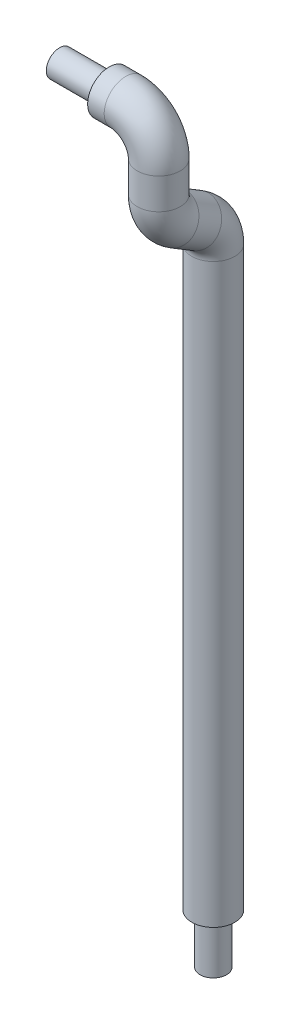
ISO-10303-21;
HEADER;
FILE_DESCRIPTION(('STEP AP214'),'2;1');
FILE_NAME('part.step','',(''),(''),'','','');
FILE_SCHEMA(('AUTOMOTIVE_DESIGN { 1 0 10303 214 1 1 1 1 }'));
ENDSEC;
DATA;
#1=APPLICATION_CONTEXT('core data for automotive mechanical design processes');
#2=APPLICATION_PROTOCOL_DEFINITION('international standard','automotive_design',2000,#1);
#3=PRODUCT_CONTEXT('',#1,'mechanical');
#4=PRODUCT('Part','Part','',(#3));
#5=PRODUCT_RELATED_PRODUCT_CATEGORY('part','',(#4));
#6=PRODUCT_DEFINITION_FORMATION('','',#4);
#7=PRODUCT_DEFINITION_CONTEXT('part definition',#1,'design');
#8=PRODUCT_DEFINITION('design','',#6,#7);
#9=PRODUCT_DEFINITION_SHAPE('','',#8);
#10=(LENGTH_UNIT() NAMED_UNIT(*) SI_UNIT(.MILLI.,.METRE.));
#11=(NAMED_UNIT(*) PLANE_ANGLE_UNIT() SI_UNIT($,.RADIAN.));
#12=(NAMED_UNIT(*) SI_UNIT($,.STERADIAN.) SOLID_ANGLE_UNIT());
#13=UNCERTAINTY_MEASURE_WITH_UNIT(LENGTH_MEASURE(1.E-05),#10,'distance_accuracy_value','');
#14=(GEOMETRIC_REPRESENTATION_CONTEXT(3) GLOBAL_UNCERTAINTY_ASSIGNED_CONTEXT((#13)) GLOBAL_UNIT_ASSIGNED_CONTEXT((#10,
#11,#12)) REPRESENTATION_CONTEXT('',''));
#15=CARTESIAN_POINT('',(0.,0.,0.));
#16=DIRECTION('',(0.,0.,1.));
#17=DIRECTION('',(1.,0.,0.));
#18=AXIS2_PLACEMENT_3D('',#15,#16,#17);
#19=CARTESIAN_POINT('',(-8.,-8.,-17.25));
#20=DIRECTION('',(1.,0.,0.));
#21=DIRECTION('',(0.,0.,-1.));
#22=AXIS2_PLACEMENT_3D('',#19,#20,#21);
#23=PLANE('',#22);
#24=CARTESIAN_POINT('',(-8.,-8.,-17.25));
#25=DIRECTION('',(-1.,0.,0.));
#26=DIRECTION('',(0.,0.,1.));
#27=AXIS2_PLACEMENT_3D('',#24,#25,#26);
#28=CIRCLE('',#27,0.4);
#29=CARTESIAN_POINT('',(-8.,-8.,-16.85));
#30=VERTEX_POINT('',#29);
#31=EDGE_CURVE('E18',#30,#30,#28,.F.);
#32=ORIENTED_EDGE('',*,*,#31,.F.);
#33=EDGE_LOOP('',(#32));
#34=FACE_BOUND('',#33,.T.);
#35=ADVANCED_FACE('F15',(#34),#23,.F.);
#36=CARTESIAN_POINT('',(-8.,-8.,-17.25));
#37=DIRECTION('',(-1.,0.,0.));
#38=DIRECTION('',(0.,0.,1.));
#39=AXIS2_PLACEMENT_3D('',#36,#37,#38);
#40=CYLINDRICAL_SURFACE('',#39,0.4);
#41=CARTESIAN_POINT('',(-6.5,-8.,-17.25));
#42=DIRECTION('',(-1.,0.,0.));
#43=DIRECTION('',(0.,0.,1.));
#44=AXIS2_PLACEMENT_3D('',#41,#42,#43);
#45=CIRCLE('',#44,0.4);
#46=CARTESIAN_POINT('',(-6.5,-8.,-16.85));
#47=VERTEX_POINT('',#46);
#48=EDGE_CURVE('E43',#47,#47,#45,.F.);
#49=ORIENTED_EDGE('',*,*,#48,.F.);
#50=EDGE_LOOP('',(#49));
#51=FACE_BOUND('',#50,.T.);
#52=ORIENTED_EDGE('',*,*,#31,.T.);
#53=EDGE_LOOP('',(#52));
#54=FACE_BOUND('',#53,.T.);
#55=ADVANCED_FACE('F50',(#51,#54),#40,.T.);
#56=CARTESIAN_POINT('',(-6.5,0.,0.));
#57=DIRECTION('',(-1.,0.,0.));
#58=DIRECTION('',(0.,0.,1.));
#59=AXIS2_PLACEMENT_3D('',#56,#57,#58);
#60=PLANE('',#59);
#61=ORIENTED_EDGE('',*,*,#48,.T.);
#62=EDGE_LOOP('',(#61));
#63=FACE_BOUND('',#62,.T.);
#64=CARTESIAN_POINT('',(-6.5,-8.,-17.25));
#65=DIRECTION('',(1.,0.,0.));
#66=DIRECTION('',(0.,0.,-1.));
#67=AXIS2_PLACEMENT_3D('',#64,#65,#66);
#68=CIRCLE('',#67,0.65);
#69=CARTESIAN_POINT('',(-6.5,-8.,-17.9));
#70=VERTEX_POINT('',#69);
#71=EDGE_CURVE('E40',#70,#70,#68,.T.);
#72=ORIENTED_EDGE('',*,*,#71,.F.);
#73=EDGE_LOOP('',(#72));
#74=FACE_BOUND('',#73,.T.);
#75=ADVANCED_FACE('F57',(#63,#74),#60,.T.);
#76=CARTESIAN_POINT('',(-8.,-8.,-17.25));
#77=DIRECTION('',(1.,0.,0.));
#78=DIRECTION('',(0.,0.,-1.));
#79=AXIS2_PLACEMENT_3D('',#76,#77,#78);
#80=CYLINDRICAL_SURFACE('',#79,0.65);
#81=CARTESIAN_POINT('',(-6.,-8.,-17.25));
#82=DIRECTION('',(1.,0.,0.));
#83=DIRECTION('',(0.,1.,0.));
#84=AXIS2_PLACEMENT_3D('',#81,#82,#83);
#85=CIRCLE('',#84,0.65);
#86=CARTESIAN_POINT('',(-6.,-7.35,-17.25));
#87=VERTEX_POINT('',#86);
#88=EDGE_CURVE('E42',#87,#87,#85,.T.);
#89=ORIENTED_EDGE('',*,*,#88,.F.);
#90=EDGE_LOOP('',(#89));
#91=FACE_BOUND('',#90,.T.);
#92=ORIENTED_EDGE('',*,*,#71,.T.);
#93=EDGE_LOOP('',(#92));
#94=FACE_BOUND('',#93,.T.);
#95=ADVANCED_FACE('F99',(#91,#94),#80,.T.);
#96=CARTESIAN_POINT('',(-6.,-9.,-17.25));
#97=DIRECTION('',(0.,0.,-1.));
#98=DIRECTION('',(0.,-1.,0.));
#99=AXIS2_PLACEMENT_3D('',#96,#97,#98);
#100=TOROIDAL_SURFACE('',#99,1.,0.65);
#101=CARTESIAN_POINT('',(-5.,-9.,-17.25));
#102=DIRECTION('',(0.,-1.,0.));
#103=DIRECTION('',(0.,0.,-1.));
#104=AXIS2_PLACEMENT_3D('',#101,#102,#103);
#105=CIRCLE('',#104,0.65);
#106=CARTESIAN_POINT('',(-5.,-9.,-17.9));
#107=VERTEX_POINT('',#106);
#108=EDGE_CURVE('E31',#107,#107,#105,.T.);
#109=ORIENTED_EDGE('',*,*,#108,.F.);
#110=EDGE_LOOP('',(#109));
#111=FACE_BOUND('',#110,.T.);
#112=ORIENTED_EDGE('',*,*,#88,.T.);
#113=EDGE_LOOP('',(#112));
#114=FACE_BOUND('',#113,.T.);
#115=ADVANCED_FACE('F94',(#111,#114),#100,.T.);
#116=CARTESIAN_POINT('',(-5.,-9.,-17.25));
#117=DIRECTION('',(0.,-1.,0.));
#118=DIRECTION('',(0.,0.,-1.));
#119=AXIS2_PLACEMENT_3D('',#116,#117,#118);
#120=CYLINDRICAL_SURFACE('',#119,0.65);
#121=CARTESIAN_POINT('',(-5.,-9.936740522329,-17.25));
#122=DIRECTION('',(0.,-1.,0.));
#123=DIRECTION('',(0.,0.,1.));
#124=AXIS2_PLACEMENT_3D('',#121,#122,#123);
#125=CIRCLE('',#124,0.65);
#126=CARTESIAN_POINT('',(-5.,-9.936740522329,-16.6));
#127=VERTEX_POINT('',#126);
#128=EDGE_CURVE('E103',#127,#127,#125,.T.);
#129=ORIENTED_EDGE('',*,*,#128,.F.);
#130=EDGE_LOOP('',(#129));
#131=FACE_BOUND('',#130,.T.);
#132=ORIENTED_EDGE('',*,*,#108,.T.);
#133=EDGE_LOOP('',(#132));
#134=FACE_BOUND('',#133,.T.);
#135=ADVANCED_FACE('F90',(#131,#134),#120,.T.);
#136=CARTESIAN_POINT('',(-5.,-9.936740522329,-18.25));
#137=DIRECTION('',(1.,0.,0.));
#138=DIRECTION('',(0.,0.,-1.));
#139=AXIS2_PLACEMENT_3D('',#136,#137,#138);
#140=TOROIDAL_SURFACE('',#139,1.,0.65);
#141=CARTESIAN_POINT('',(-5.,-10.7919383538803,-17.7316982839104));
#142=DIRECTION('',(0.,-0.51830171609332,-0.855197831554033));
#143=DIRECTION('',(0.,0.855197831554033,-0.51830171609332));
#144=AXIS2_PLACEMENT_3D('',#141,#142,#143);
#145=CIRCLE('',#144,0.65);
#146=CARTESIAN_POINT('',(-5.,-10.2360597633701,-18.0685943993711));
#147=VERTEX_POINT('',#146);
#148=EDGE_CURVE('E39',#147,#147,#145,.T.);
#149=ORIENTED_EDGE('',*,*,#148,.F.);
#150=EDGE_LOOP('',(#149));
#151=FACE_BOUND('',#150,.T.);
#152=ORIENTED_EDGE('',*,*,#128,.T.);
#153=EDGE_LOOP('',(#152));
#154=FACE_BOUND('',#153,.T.);
#155=ADVANCED_FACE('F85',(#151,#154),#140,.T.);
#156=CARTESIAN_POINT('',(-5.,-31.,-18.9));
#157=DIRECTION('',(0.,-1.,0.));
#158=DIRECTION('',(0.,0.,-1.));
#159=AXIS2_PLACEMENT_3D('',#156,#157,#158);
#160=PLANE('',#159);
#161=CARTESIAN_POINT('',(-5.,-31.,-18.9));
#162=DIRECTION('',(0.,-1.,0.));
#163=DIRECTION('',(0.,0.,-1.));
#164=AXIS2_PLACEMENT_3D('',#161,#162,#163);
#165=CIRCLE('',#164,0.4);
#166=CARTESIAN_POINT('',(-5.,-31.,-19.3));
#167=VERTEX_POINT('',#166);
#168=EDGE_CURVE('E36',#167,#167,#165,.F.);
#169=ORIENTED_EDGE('',*,*,#168,.F.);
#170=EDGE_LOOP('',(#169));
#171=FACE_BOUND('',#170,.T.);
#172=ADVANCED_FACE('F89',(#171),#160,.T.);
#173=CARTESIAN_POINT('',(-5.,-10.79193835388,-17.73169828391));
#174=DIRECTION('',(0.,-0.51830171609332,-0.855197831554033));
#175=DIRECTION('',(0.,0.855197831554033,-0.51830171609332));
#176=AXIS2_PLACEMENT_3D('',#173,#174,#175);
#177=CYLINDRICAL_SURFACE('',#176,0.65);
#178=CARTESIAN_POINT('',(-5.,-11.2080616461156,-18.4183017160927));
#179=DIRECTION('',(0.,-0.518301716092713,-0.8551978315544));
#180=DIRECTION('',(0.,0.8551978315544,-0.518301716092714));
#181=AXIS2_PLACEMENT_3D('',#178,#179,#180);
#182=CIRCLE('',#181,0.65);
#183=CARTESIAN_POINT('',(-5.,-10.6521830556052,-18.755197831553));
#184=VERTEX_POINT('',#183);
#185=EDGE_CURVE('E35',#184,#184,#182,.T.);
#186=ORIENTED_EDGE('',*,*,#185,.F.);
#187=EDGE_LOOP('',(#186));
#188=FACE_BOUND('',#187,.T.);
#189=ORIENTED_EDGE('',*,*,#148,.T.);
#190=EDGE_LOOP('',(#189));
#191=FACE_BOUND('',#190,.T.);
#192=ADVANCED_FACE('F116',(#188,#191),#177,.T.);
#193=CARTESIAN_POINT('',(-5.,-21.,-18.9));
#194=DIRECTION('',(0.,-1.,0.));
#195=DIRECTION('',(0.,0.,-1.));
#196=AXIS2_PLACEMENT_3D('',#193,#194,#195);
#197=CYLINDRICAL_SURFACE('',#196,0.4);
#198=CARTESIAN_POINT('',(-5.,-29.5,-18.9));
#199=DIRECTION('',(0.,-1.,0.));
#200=DIRECTION('',(0.,0.,-1.));
#201=AXIS2_PLACEMENT_3D('',#198,#199,#200);
#202=CIRCLE('',#201,0.4);
#203=CARTESIAN_POINT('',(-5.,-29.5,-19.3));
#204=VERTEX_POINT('',#203);
#205=EDGE_CURVE('E27',#204,#204,#202,.F.);
#206=ORIENTED_EDGE('',*,*,#205,.F.);
#207=EDGE_LOOP('',(#206));
#208=FACE_BOUND('',#207,.T.);
#209=ORIENTED_EDGE('',*,*,#168,.T.);
#210=EDGE_LOOP('',(#209));
#211=FACE_BOUND('',#210,.T.);
#212=ADVANCED_FACE('F74',(#208,#211),#197,.T.);
#213=CARTESIAN_POINT('',(-5.,-12.06325947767,-17.9));
#214=DIRECTION('',(-1.,0.,0.));
#215=DIRECTION('',(0.,-0.855197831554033,0.518301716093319));
#216=AXIS2_PLACEMENT_3D('',#213,#214,#215);
#217=TOROIDAL_SURFACE('',#216,0.999999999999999,0.65);
#218=CARTESIAN_POINT('',(-5.,-12.06325947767,-18.9));
#219=DIRECTION('',(0.,-1.,0.));
#220=DIRECTION('',(0.,0.,-1.));
#221=AXIS2_PLACEMENT_3D('',#218,#219,#220);
#222=CIRCLE('',#221,0.65);
#223=CARTESIAN_POINT('',(-5.,-12.06325947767,-19.55));
#224=VERTEX_POINT('',#223);
#225=EDGE_CURVE('E22',#224,#224,#222,.T.);
#226=ORIENTED_EDGE('',*,*,#225,.F.);
#227=EDGE_LOOP('',(#226));
#228=FACE_BOUND('',#227,.T.);
#229=ORIENTED_EDGE('',*,*,#185,.T.);
#230=EDGE_LOOP('',(#229));
#231=FACE_BOUND('',#230,.T.);
#232=ADVANCED_FACE('F67',(#228,#231),#217,.T.);
#233=CARTESIAN_POINT('',(0.,-29.5,0.));
#234=DIRECTION('',(0.,-1.,0.));
#235=DIRECTION('',(0.,0.,-1.));
#236=AXIS2_PLACEMENT_3D('',#233,#234,#235);
#237=PLANE('',#236);
#238=ORIENTED_EDGE('',*,*,#205,.T.);
#239=EDGE_LOOP('',(#238));
#240=FACE_BOUND('',#239,.T.);
#241=CARTESIAN_POINT('',(-5.,-29.5,-18.9));
#242=DIRECTION('',(0.,-1.,0.));
#243=DIRECTION('',(0.,0.,-1.));
#244=AXIS2_PLACEMENT_3D('',#241,#242,#243);
#245=CIRCLE('',#244,0.65);
#246=CARTESIAN_POINT('',(-5.,-29.5,-19.55));
#247=VERTEX_POINT('',#246);
#248=EDGE_CURVE('E10',#247,#247,#245,.F.);
#249=ORIENTED_EDGE('',*,*,#248,.F.);
#250=EDGE_LOOP('',(#249));
#251=FACE_BOUND('',#250,.T.);
#252=ADVANCED_FACE('F61',(#240,#251),#237,.T.);
#253=CARTESIAN_POINT('',(-5.,-12.06325947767,-18.9));
#254=DIRECTION('',(0.,-1.,0.));
#255=DIRECTION('',(0.,0.,-1.));
#256=AXIS2_PLACEMENT_3D('',#253,#254,#255);
#257=CYLINDRICAL_SURFACE('',#256,0.65);
#258=ORIENTED_EDGE('',*,*,#225,.T.);
#259=EDGE_LOOP('',(#258));
#260=FACE_BOUND('',#259,.T.);
#261=ORIENTED_EDGE('',*,*,#248,.T.);
#262=EDGE_LOOP('',(#261));
#263=FACE_BOUND('',#262,.T.);
#264=ADVANCED_FACE('F59',(#260,#263),#257,.T.);
#265=CLOSED_SHELL('',(#35,#55,#75,#95,#115,#135,#155,#172,#192,#212,#232,#252,#264));
#266=MANIFOLD_SOLID_BREP('B1',#265);
#267=ADVANCED_BREP_SHAPE_REPRESENTATION('',(#18,#266),#14);
#268=SHAPE_DEFINITION_REPRESENTATION(#9,#267);
ENDSEC;
END-ISO-10303-21;
